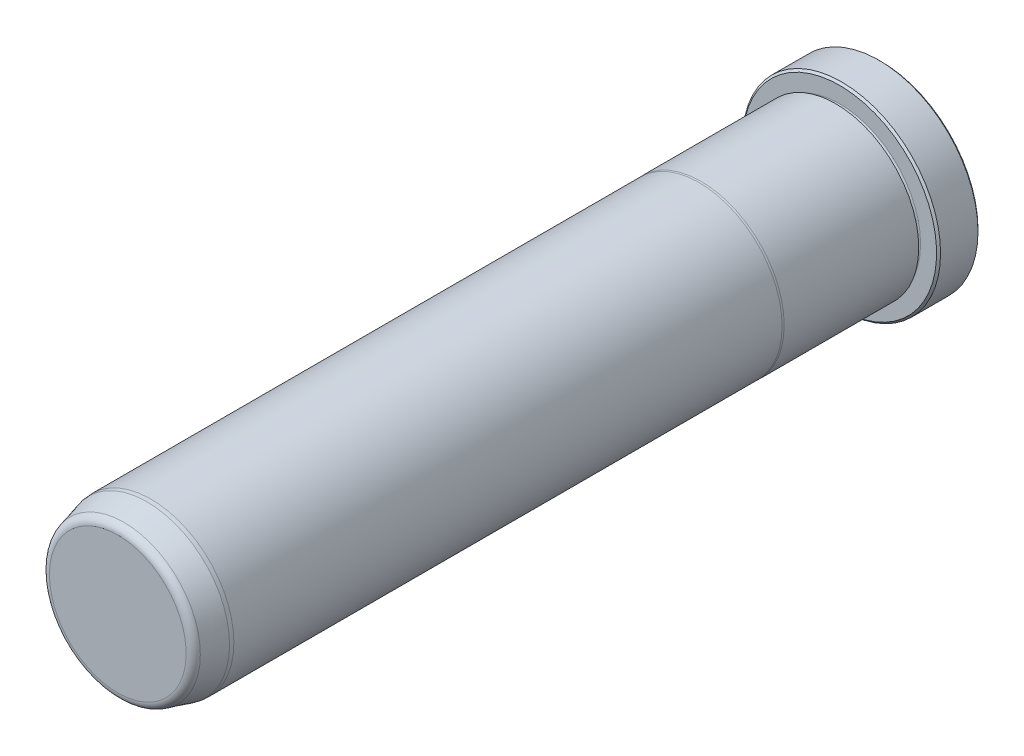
ISO-10303-21;
HEADER;
FILE_DESCRIPTION(('STEP AP214'),'2;1');
FILE_NAME('part.step','',(''),(''),'','','');
FILE_SCHEMA(('AUTOMOTIVE_DESIGN { 1 0 10303 214 1 1 1 1 }'));
ENDSEC;
DATA;
#1=APPLICATION_CONTEXT('core data for automotive mechanical design processes');
#2=APPLICATION_PROTOCOL_DEFINITION('international standard','automotive_design',2000,#1);
#3=PRODUCT_CONTEXT('',#1,'mechanical');
#4=PRODUCT('Part','Part','',(#3));
#5=PRODUCT_RELATED_PRODUCT_CATEGORY('part','',(#4));
#6=PRODUCT_DEFINITION_FORMATION('','',#4);
#7=PRODUCT_DEFINITION_CONTEXT('part definition',#1,'design');
#8=PRODUCT_DEFINITION('design','',#6,#7);
#9=PRODUCT_DEFINITION_SHAPE('','',#8);
#10=(LENGTH_UNIT() NAMED_UNIT(*) SI_UNIT(.MILLI.,.METRE.));
#11=(NAMED_UNIT(*) PLANE_ANGLE_UNIT() SI_UNIT($,.RADIAN.));
#12=(NAMED_UNIT(*) SI_UNIT($,.STERADIAN.) SOLID_ANGLE_UNIT());
#13=UNCERTAINTY_MEASURE_WITH_UNIT(LENGTH_MEASURE(1.E-05),#10,'distance_accuracy_value','');
#14=(GEOMETRIC_REPRESENTATION_CONTEXT(3) GLOBAL_UNCERTAINTY_ASSIGNED_CONTEXT((#13)) GLOBAL_UNIT_ASSIGNED_CONTEXT((#10,
#11,#12)) REPRESENTATION_CONTEXT('',''));
#15=CARTESIAN_POINT('',(0.,0.,0.));
#16=DIRECTION('',(0.,0.,1.));
#17=DIRECTION('',(1.,0.,0.));
#18=AXIS2_PLACEMENT_3D('',#15,#16,#17);
#19=CARTESIAN_POINT('',(0.,0.,0.));
#20=DIRECTION('',(0.,0.,1.));
#21=DIRECTION('',(1.,0.,0.));
#22=AXIS2_PLACEMENT_3D('',#19,#20,#21);
#23=PLANE('',#22);
#24=CARTESIAN_POINT('',(0.,0.,0.));
#25=DIRECTION('',(0.,0.,1.));
#26=DIRECTION('',(1.,0.,0.));
#27=AXIS2_PLACEMENT_3D('',#24,#25,#26);
#28=CIRCLE('',#27,18.542);
#29=CARTESIAN_POINT('',(18.542,0.,0.));
#30=VERTEX_POINT('',#29);
#31=EDGE_CURVE('E37',#30,#30,#28,.F.);
#32=ORIENTED_EDGE('',*,*,#31,.T.);
#33=EDGE_LOOP('',(#32));
#34=FACE_BOUND('',#33,.T.);
#35=ADVANCED_FACE('F30',(#34),#23,.F.);
#36=CARTESIAN_POINT('',(0.,0.,0.));
#37=DIRECTION('',(0.,0.,1.));
#38=DIRECTION('',(1.,0.,0.));
#39=AXIS2_PLACEMENT_3D('',#36,#37,#38);
#40=CYLINDRICAL_SURFACE('',#39,18.923);
#41=CARTESIAN_POINT('',(0.,0.,0.380999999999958));
#42=DIRECTION('',(0.,0.,1.));
#43=DIRECTION('',(1.,0.,0.));
#44=AXIS2_PLACEMENT_3D('',#41,#42,#43);
#45=CIRCLE('',#44,18.923);
#46=CARTESIAN_POINT('',(18.923,0.,0.380999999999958));
#47=VERTEX_POINT('',#46);
#48=EDGE_CURVE('E41',#47,#47,#45,.T.);
#49=ORIENTED_EDGE('',*,*,#48,.T.);
#50=EDGE_LOOP('',(#49));
#51=FACE_BOUND('',#50,.T.);
#52=CARTESIAN_POINT('',(0.,0.,7.54380000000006));
#53=DIRECTION('',(0.,0.,-1.));
#54=DIRECTION('',(-1.,0.,0.));
#55=AXIS2_PLACEMENT_3D('',#52,#53,#54);
#56=CIRCLE('',#55,18.923);
#57=CARTESIAN_POINT('',(-18.923,0.,7.54380000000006));
#58=VERTEX_POINT('',#57);
#59=EDGE_CURVE('E45',#58,#58,#56,.T.);
#60=ORIENTED_EDGE('',*,*,#59,.T.);
#61=EDGE_LOOP('',(#60));
#62=FACE_BOUND('',#61,.T.);
#63=ADVANCED_FACE('F118',(#51,#62),#40,.T.);
#64=CARTESIAN_POINT('',(0.,18.923,7.9248));
#65=DIRECTION('',(0.,0.,-1.));
#66=DIRECTION('',(-1.,0.,0.));
#67=AXIS2_PLACEMENT_3D('',#64,#65,#66);
#68=PLANE('',#67);
#69=CARTESIAN_POINT('',(0.,0.,7.9248));
#70=DIRECTION('',(0.,0.,-1.));
#71=DIRECTION('',(-1.,0.,0.));
#72=AXIS2_PLACEMENT_3D('',#69,#70,#71);
#73=CIRCLE('',#72,18.542);
#74=CARTESIAN_POINT('',(-18.542,0.,7.9248));
#75=VERTEX_POINT('',#74);
#76=EDGE_CURVE('E10',#75,#75,#73,.F.);
#77=ORIENTED_EDGE('',*,*,#76,.T.);
#78=EDGE_LOOP('',(#77));
#79=FACE_BOUND('',#78,.T.);
#80=CARTESIAN_POINT('',(0.,0.,7.9248));
#81=DIRECTION('',(0.,0.,1.));
#82=DIRECTION('',(1.,0.,0.));
#83=AXIS2_PLACEMENT_3D('',#80,#81,#82);
#84=CIRCLE('',#83,15.4813);
#85=CARTESIAN_POINT('',(15.4813,0.,7.9248));
#86=VERTEX_POINT('',#85);
#87=EDGE_CURVE('E56',#86,#86,#84,.T.);
#88=ORIENTED_EDGE('',*,*,#87,.F.);
#89=EDGE_LOOP('',(#88));
#90=FACE_BOUND('',#89,.T.);
#91=ADVANCED_FACE('F113',(#79,#90),#68,.F.);
#92=CARTESIAN_POINT('',(0.,0.,8.3058));
#93=DIRECTION('',(0.,0.,1.));
#94=DIRECTION('',(1.,0.,0.));
#95=AXIS2_PLACEMENT_3D('',#92,#93,#94);
#96=TOROIDAL_SURFACE('',#95,15.4813,0.381000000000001);
#97=CARTESIAN_POINT('',(0.,0.,8.6868));
#98=DIRECTION('',(0.,0.,1.));
#99=DIRECTION('',(1.,0.,0.));
#100=AXIS2_PLACEMENT_3D('',#97,#98,#99);
#101=CIRCLE('',#100,15.4813);
#102=CARTESIAN_POINT('',(15.4813,0.,8.6868));
#103=VERTEX_POINT('',#102);
#104=EDGE_CURVE('E59',#103,#103,#101,.T.);
#105=ORIENTED_EDGE('',*,*,#104,.F.);
#106=EDGE_LOOP('',(#105));
#107=FACE_BOUND('',#106,.T.);
#108=ORIENTED_EDGE('',*,*,#87,.T.);
#109=EDGE_LOOP('',(#108));
#110=FACE_BOUND('',#109,.T.);
#111=ADVANCED_FACE('F107',(#107,#110),#96,.F.);
#112=CARTESIAN_POINT('',(0.,15.4813,8.6868));
#113=DIRECTION('',(0.,0.,1.));
#114=DIRECTION('',(1.,0.,0.));
#115=AXIS2_PLACEMENT_3D('',#112,#113,#114);
#116=PLANE('',#115);
#117=CARTESIAN_POINT('',(0.,0.,8.6868));
#118=DIRECTION('',(0.,0.,1.));
#119=DIRECTION('',(1.,0.,0.));
#120=AXIS2_PLACEMENT_3D('',#117,#118,#119);
#121=CIRCLE('',#120,15.8877);
#122=CARTESIAN_POINT('',(15.8877,0.,8.6868));
#123=VERTEX_POINT('',#122);
#124=EDGE_CURVE('E62',#123,#123,#121,.T.);
#125=ORIENTED_EDGE('',*,*,#124,.F.);
#126=EDGE_LOOP('',(#125));
#127=FACE_BOUND('',#126,.T.);
#128=ORIENTED_EDGE('',*,*,#104,.T.);
#129=EDGE_LOOP('',(#128));
#130=FACE_BOUND('',#129,.T.);
#131=ADVANCED_FACE('F101',(#127,#130),#116,.F.);
#132=CARTESIAN_POINT('',(0.,0.,0.));
#133=DIRECTION('',(0.,0.,1.));
#134=DIRECTION('',(1.,0.,0.));
#135=AXIS2_PLACEMENT_3D('',#132,#133,#134);
#136=CYLINDRICAL_SURFACE('',#135,15.8877);
#137=CARTESIAN_POINT('',(0.,0.,34.4347630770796));
#138=DIRECTION('',(0.,0.,1.));
#139=DIRECTION('',(1.,0.,0.));
#140=AXIS2_PLACEMENT_3D('',#137,#138,#139);
#141=CIRCLE('',#140,15.8877);
#142=CARTESIAN_POINT('',(15.8877,0.,34.4347630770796));
#143=VERTEX_POINT('',#142);
#144=EDGE_CURVE('E65',#143,#143,#141,.T.);
#145=ORIENTED_EDGE('',*,*,#144,.F.);
#146=EDGE_LOOP('',(#145));
#147=FACE_BOUND('',#146,.T.);
#148=ORIENTED_EDGE('',*,*,#124,.T.);
#149=EDGE_LOOP('',(#148));
#150=FACE_BOUND('',#149,.T.);
#151=ADVANCED_FACE('F95',(#147,#150),#136,.T.);
#152=CARTESIAN_POINT('',(0.,0.,34.4347630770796));
#153=DIRECTION('',(0.,0.,-1.));
#154=DIRECTION('',(-1.,0.,0.));
#155=AXIS2_PLACEMENT_3D('',#152,#153,#154);
#156=CONICAL_SURFACE('',#155,15.8877,0.0698131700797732);
#157=CARTESIAN_POINT('',(0.,0.,34.798));
#158=DIRECTION('',(0.,0.,1.));
#159=DIRECTION('',(1.,0.,0.));
#160=AXIS2_PLACEMENT_3D('',#157,#158,#159);
#161=CIRCLE('',#160,15.8623);
#162=CARTESIAN_POINT('',(15.8623,0.,34.798));
#163=VERTEX_POINT('',#162);
#164=EDGE_CURVE('E68',#163,#163,#161,.T.);
#165=ORIENTED_EDGE('',*,*,#164,.F.);
#166=EDGE_LOOP('',(#165));
#167=FACE_BOUND('',#166,.T.);
#168=ORIENTED_EDGE('',*,*,#144,.T.);
#169=EDGE_LOOP('',(#168));
#170=FACE_BOUND('',#169,.T.);
#171=ADVANCED_FACE('F89',(#167,#170),#156,.T.);
#172=CARTESIAN_POINT('',(0.,0.,0.));
#173=DIRECTION('',(0.,0.,1.));
#174=DIRECTION('',(1.,0.,0.));
#175=AXIS2_PLACEMENT_3D('',#172,#173,#174);
#176=CYLINDRICAL_SURFACE('',#175,15.8623);
#177=CARTESIAN_POINT('',(0.,0.,139.7));
#178=DIRECTION('',(0.,0.,1.));
#179=DIRECTION('',(1.,0.,0.));
#180=AXIS2_PLACEMENT_3D('',#177,#178,#179);
#181=CIRCLE('',#180,15.8623);
#182=CARTESIAN_POINT('',(15.8623,0.,139.7));
#183=VERTEX_POINT('',#182);
#184=EDGE_CURVE('E71',#183,#183,#181,.T.);
#185=ORIENTED_EDGE('',*,*,#184,.F.);
#186=EDGE_LOOP('',(#185));
#187=FACE_BOUND('',#186,.T.);
#188=ORIENTED_EDGE('',*,*,#164,.T.);
#189=EDGE_LOOP('',(#188));
#190=FACE_BOUND('',#189,.T.);
#191=ADVANCED_FACE('F83',(#187,#190),#176,.T.);
#192=CARTESIAN_POINT('',(0.,0.,139.7));
#193=DIRECTION('',(0.,0.,-1.));
#194=DIRECTION('',(-1.,0.,0.));
#195=AXIS2_PLACEMENT_3D('',#192,#193,#194);
#196=CONICAL_SURFACE('',#195,15.8623,0.0872664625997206);
#197=CARTESIAN_POINT('',(0.,0.,140.462));
#198=DIRECTION('',(0.,0.,1.));
#199=DIRECTION('',(1.,0.,0.));
#200=AXIS2_PLACEMENT_3D('',#197,#198,#199);
#201=CIRCLE('',#200,15.7956336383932);
#202=CARTESIAN_POINT('',(15.7956336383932,0.,140.462));
#203=VERTEX_POINT('',#202);
#204=EDGE_CURVE('E74',#203,#203,#201,.T.);
#205=ORIENTED_EDGE('',*,*,#204,.F.);
#206=EDGE_LOOP('',(#205));
#207=FACE_BOUND('',#206,.T.);
#208=ORIENTED_EDGE('',*,*,#184,.T.);
#209=EDGE_LOOP('',(#208));
#210=FACE_BOUND('',#209,.T.);
#211=ADVANCED_FACE('F80',(#207,#210),#196,.T.);
#212=CARTESIAN_POINT('',(0.,0.,140.462));
#213=DIRECTION('',(0.,0.,-1.));
#214=DIRECTION('',(-1.,0.,0.));
#215=AXIS2_PLACEMENT_3D('',#212,#213,#214);
#216=CONICAL_SURFACE('',#215,15.7956336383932,0.26179938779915);
#217=CARTESIAN_POINT('',(0.,0.,144.8733752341));
#218=DIRECTION('',(0.,0.,1.));
#219=DIRECTION('',(1.,0.,0.));
#220=AXIS2_PLACEMENT_3D('',#217,#218,#219);
#221=CIRCLE('',#220,14.6136092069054);
#222=CARTESIAN_POINT('',(14.6136092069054,0.,144.8733752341));
#223=VERTEX_POINT('',#222);
#224=EDGE_CURVE('E50',#223,#223,#221,.F.);
#225=ORIENTED_EDGE('',*,*,#224,.T.);
#226=EDGE_LOOP('',(#225));
#227=FACE_BOUND('',#226,.T.);
#228=ORIENTED_EDGE('',*,*,#204,.T.);
#229=EDGE_LOOP('',(#228));
#230=FACE_BOUND('',#229,.T.);
#231=ADVANCED_FACE('F78',(#227,#230),#216,.T.);
#232=CARTESIAN_POINT('',(0.,14.2983335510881,146.05));
#233=DIRECTION('',(0.,0.,-1.));
#234=DIRECTION('',(-1.,0.,0.));
#235=AXIS2_PLACEMENT_3D('',#232,#233,#234);
#236=PLANE('',#235);
#237=CARTESIAN_POINT('',(0.,0.,146.05));
#238=DIRECTION('',(0.,0.,-1.));
#239=DIRECTION('',(-1.,0.,0.));
#240=AXIS2_PLACEMENT_3D('',#237,#238,#239);
#241=CIRCLE('',#240,13.0802019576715);
#242=CARTESIAN_POINT('',(-13.0802019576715,0.,146.05));
#243=VERTEX_POINT('',#242);
#244=EDGE_CURVE('E53',#243,#243,#241,.F.);
#245=ORIENTED_EDGE('',*,*,#244,.T.);
#246=EDGE_LOOP('',(#245));
#247=FACE_BOUND('',#246,.T.);
#248=ADVANCED_FACE('F133',(#247),#236,.F.);
#249=CARTESIAN_POINT('',(0.,0.,144.4625));
#250=DIRECTION('',(0.,0.,-1.));
#251=DIRECTION('',(-1.,0.,0.));
#252=AXIS2_PLACEMENT_3D('',#249,#250,#251);
#253=TOROIDAL_SURFACE('',#252,13.0802019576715,1.5875);
#254=ORIENTED_EDGE('',*,*,#224,.F.);
#255=EDGE_LOOP('',(#254));
#256=FACE_BOUND('',#255,.T.);
#257=ORIENTED_EDGE('',*,*,#244,.F.);
#258=EDGE_LOOP('',(#257));
#259=FACE_BOUND('',#258,.T.);
#260=ADVANCED_FACE('F130',(#256,#259),#253,.T.);
#261=CARTESIAN_POINT('',(0.,0.,0.380999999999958));
#262=DIRECTION('',(0.,0.,1.));
#263=DIRECTION('',(1.,0.,0.));
#264=AXIS2_PLACEMENT_3D('',#261,#262,#263);
#265=CONICAL_SURFACE('',#264,18.923,0.785398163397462);
#266=ORIENTED_EDGE('',*,*,#31,.F.);
#267=EDGE_LOOP('',(#266));
#268=FACE_BOUND('',#267,.T.);
#269=ORIENTED_EDGE('',*,*,#48,.F.);
#270=EDGE_LOOP('',(#269));
#271=FACE_BOUND('',#270,.T.);
#272=ADVANCED_FACE('F132',(#268,#271),#265,.T.);
#273=CARTESIAN_POINT('',(0.,0.,7.9248));
#274=DIRECTION('',(0.,0.,-1.));
#275=DIRECTION('',(-1.,0.,0.));
#276=AXIS2_PLACEMENT_3D('',#273,#274,#275);
#277=CONICAL_SURFACE('',#276,18.542,0.785398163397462);
#278=CARTESIAN_POINT('',(-18.923,0.,7.54380000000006));
#279=CARTESIAN_POINT('',(-18.91903125,0.,7.54776875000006));
#280=CARTESIAN_POINT('',(-18.9150625,0.,7.55173750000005));
#281=CARTESIAN_POINT('',(-18.907125,0.,7.55967500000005));
#282=CARTESIAN_POINT('',(-18.90315625,0.,7.56364375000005));
#283=CARTESIAN_POINT('',(-18.89521875,0.,7.57158125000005));
#284=CARTESIAN_POINT('',(-18.89125,0.,7.57555000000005));
#285=CARTESIAN_POINT('',(-18.8833125,0.,7.58348750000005));
#286=CARTESIAN_POINT('',(-18.87934375,0.,7.58745625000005));
#287=CARTESIAN_POINT('',(-18.87140625,0.,7.59539375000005));
#288=CARTESIAN_POINT('',(-18.8674375,0.,7.59936250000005));
#289=CARTESIAN_POINT('',(-18.8595,0.,7.60730000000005));
#290=CARTESIAN_POINT('',(-18.85553125,0.,7.61126875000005));
#291=CARTESIAN_POINT('',(-18.84759375,0.,7.61920625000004));
#292=CARTESIAN_POINT('',(-18.843625,0.,7.62317500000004));
#293=CARTESIAN_POINT('',(-18.8356875,0.,7.63111250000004));
#294=CARTESIAN_POINT('',(-18.83171875,0.,7.63508125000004));
#295=CARTESIAN_POINT('',(-18.82378125,0.,7.64301875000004));
#296=CARTESIAN_POINT('',(-18.8198125,0.,7.64698750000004));
#297=CARTESIAN_POINT('',(-18.811875,0.,7.65492500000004));
#298=CARTESIAN_POINT('',(-18.80790625,0.,7.65889375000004));
#299=CARTESIAN_POINT('',(-18.79996875,0.,7.66683125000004));
#300=CARTESIAN_POINT('',(-18.796,0.,7.67080000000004));
#301=CARTESIAN_POINT('',(-18.7880625,0.,7.67873750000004));
#302=CARTESIAN_POINT('',(-18.78409375,0.,7.68270625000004));
#303=CARTESIAN_POINT('',(-18.77615625,0.,7.69064375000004));
#304=CARTESIAN_POINT('',(-18.7721875,0.,7.69461250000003));
#305=CARTESIAN_POINT('',(-18.76425,0.,7.70255000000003));
#306=CARTESIAN_POINT('',(-18.76028125,0.,7.70651875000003));
#307=CARTESIAN_POINT('',(-18.75234375,0.,7.71445625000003));
#308=CARTESIAN_POINT('',(-18.748375,0.,7.71842500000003));
#309=CARTESIAN_POINT('',(-18.7404375,0.,7.72636250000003));
#310=CARTESIAN_POINT('',(-18.73646875,0.,7.73033125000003));
#311=CARTESIAN_POINT('',(-18.72853125,0.,7.73826875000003));
#312=CARTESIAN_POINT('',(-18.7245625,0.,7.74223750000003));
#313=CARTESIAN_POINT('',(-18.716625,0.,7.75017500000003));
#314=CARTESIAN_POINT('',(-18.71265625,0.,7.75414375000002));
#315=CARTESIAN_POINT('',(-18.70471875,0.,7.76208125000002));
#316=CARTESIAN_POINT('',(-18.70075,0.,7.76605000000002));
#317=CARTESIAN_POINT('',(-18.6928125,0.,7.77398750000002));
#318=CARTESIAN_POINT('',(-18.68884375,0.,7.77795625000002));
#319=CARTESIAN_POINT('',(-18.68090625,0.,7.78589375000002));
#320=CARTESIAN_POINT('',(-18.6769375,0.,7.78986250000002));
#321=CARTESIAN_POINT('',(-18.669,0.,7.79780000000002));
#322=CARTESIAN_POINT('',(-18.66503125,0.,7.80176875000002));
#323=CARTESIAN_POINT('',(-18.65709375,0.,7.80970625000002));
#324=CARTESIAN_POINT('',(-18.653125,0.,7.81367500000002));
#325=CARTESIAN_POINT('',(-18.6451875,0.,7.82161250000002));
#326=CARTESIAN_POINT('',(-18.64121875,0.,7.82558125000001));
#327=CARTESIAN_POINT('',(-18.63328125,0.,7.83351875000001));
#328=CARTESIAN_POINT('',(-18.6293125,0.,7.83748750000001));
#329=CARTESIAN_POINT('',(-18.621375,0.,7.84542500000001));
#330=CARTESIAN_POINT('',(-18.61740625,0.,7.84939375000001));
#331=CARTESIAN_POINT('',(-18.60946875,0.,7.85733125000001));
#332=CARTESIAN_POINT('',(-18.6055,0.,7.86130000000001));
#333=CARTESIAN_POINT('',(-18.5975625,0.,7.86923750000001));
#334=CARTESIAN_POINT('',(-18.59359375,0.,7.87320625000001));
#335=CARTESIAN_POINT('',(-18.58565625,0.,7.88114375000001));
#336=CARTESIAN_POINT('',(-18.5816875,0.,7.88511250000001));
#337=CARTESIAN_POINT('',(-18.57375,0.,7.89305000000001));
#338=CARTESIAN_POINT('',(-18.56978125,0.,7.89701875));
#339=CARTESIAN_POINT('',(-18.56184375,0.,7.90495625));
#340=CARTESIAN_POINT('',(-18.557875,0.,7.908925));
#341=CARTESIAN_POINT('',(-18.5499375,0.,7.9168625));
#342=CARTESIAN_POINT('',(-18.54596875,0.,7.92083125));
#343=CARTESIAN_POINT('',(-18.542,0.,7.9248));
#344=B_SPLINE_CURVE_WITH_KNOTS('',3,(#278,#279,#280,#281,#282,#283,#284,#285,#286,#287,#288,
#289,#290,#291,#292,#293,#294,#295,#296,#297,#298,#299,#300,#301,#302,#303,#304,#305,#306,#307,
#308,#309,#310,#311,#312,#313,#314,#315,#316,#317,#318,#319,#320,#321,#322,#323,#324,#325,#326,
#327,#328,#329,#330,#331,#332,#333,#334,#335,#336,#337,#338,#339,#340,#341,#342,#343),
.UNSPECIFIED.,.F.,.F.,(4,2,2,2,2,2,2,2,2,2,2,2,2,2,2,2,2,2,2,2,2,2,2,2,2,2,2,2,2,2,2,2,4),(0.,
0.0168379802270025,0.033675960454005,0.0505139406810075,0.0673519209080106,0.0841899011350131,
0.101027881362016,0.117865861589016,0.134703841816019,0.151541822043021,0.168379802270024,
0.185217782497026,0.202055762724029,0.218893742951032,0.235731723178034,0.252569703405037,
0.26940768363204,0.286245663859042,0.303083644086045,0.319921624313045,0.336759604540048,
0.35359758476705,0.370435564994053,0.387273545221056,0.404111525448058,0.420949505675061,
0.437787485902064,0.454625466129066,0.471463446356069,0.488301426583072,0.505139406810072,
0.521977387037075,0.538815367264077),.UNSPECIFIED.);
#345=EDGE_CURVE('BSEAM32',#58,#75,#344,.T.);
#346=ORIENTED_EDGE('',*,*,#59,.F.);
#347=ORIENTED_EDGE('',*,*,#76,.F.);
#348=ORIENTED_EDGE('',*,*,#345,.T.);
#349=ORIENTED_EDGE('',*,*,#345,.F.);
#350=EDGE_LOOP('',(#346,#348,#347,#349));
#351=FACE_BOUND('',#350,.T.);
#352=ADVANCED_FACE('F32',(#351),#277,.T.);
#353=CLOSED_SHELL('',(#35,#63,#91,#111,#131,#151,#171,#191,#211,#231,#248,#260,#272,#352));
#354=MANIFOLD_SOLID_BREP('B2',#353);
#355=ADVANCED_BREP_SHAPE_REPRESENTATION('',(#18,#354),#14);
#356=SHAPE_DEFINITION_REPRESENTATION(#9,#355);
ENDSEC;
END-ISO-10303-21;
